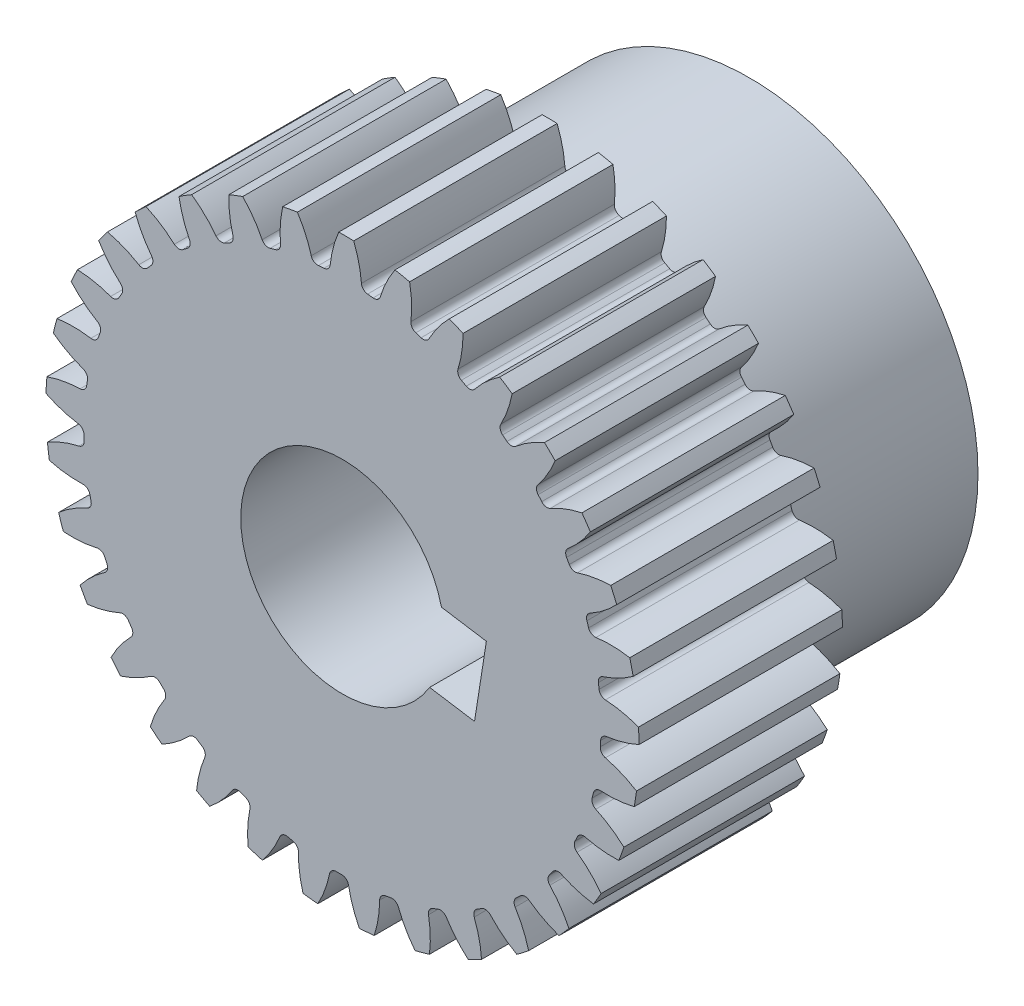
from build123d import *

# Parameters (mm, degrees)
SKETCH3_R         = 18.520833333
GEARBODY_DEPTH    = 12.7
TOOTHCUT_DEPTH    = 30.108976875
CIRPATTERN1_COUNT = 33
HUB1DIA_R         = 14.2875
HUB1_DEPTH        = 12.7
BOREDIA_R         = 6.35
BORE_DEPTH        = 12700
KWY1_DEPTH        = 6350


with BuildPart() as part:
    # Sketch3 → gearBody (new body)
    with BuildSketch(Plane.XY):
        Circle(SKETCH3_R)
    extrude(amount=GEARBODY_DEPTH)

    # Sketch2 → toothCut (cut, through all)
    with BuildSketch(Plane.XY):
        with BuildLine():
            ThreePointArc((16.10072337, -1.149428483), (16.112174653, -0.975862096), (16.121754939, -0.802182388))
            ThreePointArc((16.121754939, -0.802182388), (16.233739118, -0.536184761), (16.490422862, -0.404242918))
            ThreePointArc((16.490422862, -0.404242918), (19.235901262, 0.559488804), (21.343620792, 2.565467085))
            ThreePointArc((21.343620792, 2.565467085), (21.457928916, -1.299637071), (20.877973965, -5.122691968))
            ThreePointArc((20.877973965, -5.122691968), (19.027764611, -2.876994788), (16.418668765, -1.588953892))
            ThreePointArc((16.418668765, -1.588953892), (16.179785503, -1.426997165), (16.10072337, -1.149428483))
        make_face()
    toothcut = extrude(amount=TOOTHCUT_DEPTH, mode=Mode.SUBTRACT)

    # CirPattern1: toothCut ×33 about axis
    cirpattern1_axis = Axis((0, 0, 0), (0, 0, 1))
    for i in range(1, CIRPATTERN1_COUNT):
        add(toothcut.rotate(cirpattern1_axis, i * 360 / CIRPATTERN1_COUNT), mode=Mode.SUBTRACT)

    # hub1Dia → hub1 (add)
    with BuildSketch(Plane(origin=(0, 0, 0), x_dir=(-1, 0, 0), z_dir=(0, 0, -1))):
        with Locations(Location((0, 0, 0), (0, 0, 180))):
            Circle(HUB1DIA_R)
    extrude(amount=HUB1_DEPTH)

    # boreDia → bore (cut, symmetric)
    with BuildSketch(Plane.XY):
        Circle(BOREDIA_R)
    extrude(amount=BORE_DEPTH, both=True, mode=Mode.SUBTRACT)

    # kwy1sketch → kwy1 (cut, symmetric)
    with BuildSketch(Plane.XY):
        Polygon((8.988613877, 0.99952596), (8.250119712, -3.705368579), (2.369001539, -2.782250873), (0, 0), (3.107495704, 1.922643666), align=None)
    extrude(amount=KWY1_DEPTH, both=True, mode=Mode.SUBTRACT)


solid = part.part
